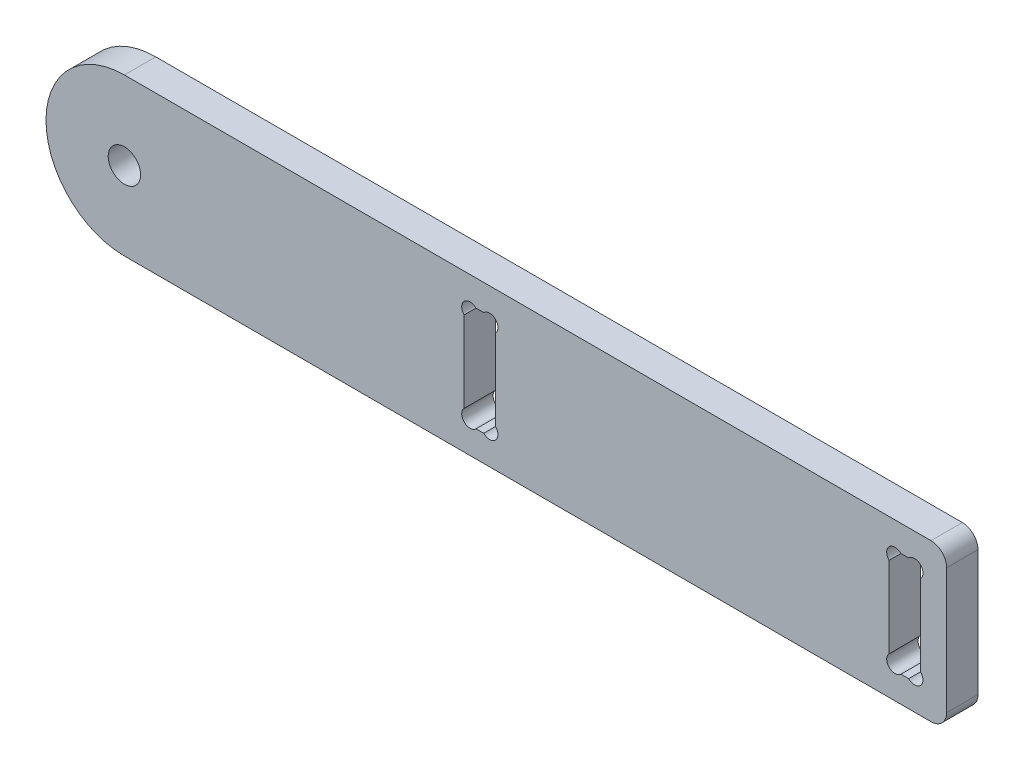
from build123d import *

# Parameters (mm, degrees)
ESQUISSE1_R      = 3.1
EXTRUSION1_DEPTH = 6


with BuildPart() as part:
    # Esquisse1 → Extrusion1 (new body)
    with BuildSketch(Plane.XY):
        with BuildLine():
            Line((94.31, 0), (-60, 0))
            ThreePointArc((-60, 0), (-75, 15), (-60, 30))
            Line((-60, 30), (94.31, 30))
            ThreePointArc((94.31, 30), (96.431320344, 29.121320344), (97.31, 27))
            Line((97.31, 27), (97.31, 3))
            ThreePointArc((97.31, 3), (96.431320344, 0.878679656), (94.31, 0))
        make_face()
        with Locations((-60, 15)):
            Circle(ESQUISSE1_R, mode=Mode.SUBTRACT)
        with BuildLine():
            Line((90.0472583, 5), (88.5727417, 5))
            ThreePointArc((88.5727417, 5), (86.31, 5), (86.31, 7.2627417))
            Line((86.31, 7.2627417), (86.31, 22.7372583))
            ThreePointArc((86.31, 22.7372583), (86.31, 25), (88.5727417, 25))
            Line((88.5727417, 25), (90.0472583, 25))
            ThreePointArc((90.0472583, 25), (92.31, 25), (92.31, 22.7372583))
            Line((92.31, 22.7372583), (92.31, 7.2627417))
            ThreePointArc((92.31, 7.2627417), (92.31, 5), (90.0472583, 5))
        make_face(mode=Mode.SUBTRACT)
        with BuildLine():
            Line((7.2627417, 25), (8.7372583, 25))
            ThreePointArc((8.7372583, 25), (11, 25), (11, 22.7372583))
            Line((11, 22.7372583), (11, 7.2627417))
            ThreePointArc((11, 7.2627417), (11, 5), (8.7372583, 5))
            Line((8.7372583, 5), (7.2627417, 5))
            ThreePointArc((7.2627417, 5), (5, 5), (5, 7.2627417))
            Line((5, 7.2627417), (5, 22.7372583))
            ThreePointArc((5, 22.7372583), (5, 25), (7.2627417, 25))
        make_face(mode=Mode.SUBTRACT)
    extrude(amount=EXTRUSION1_DEPTH)


solid = part.part
